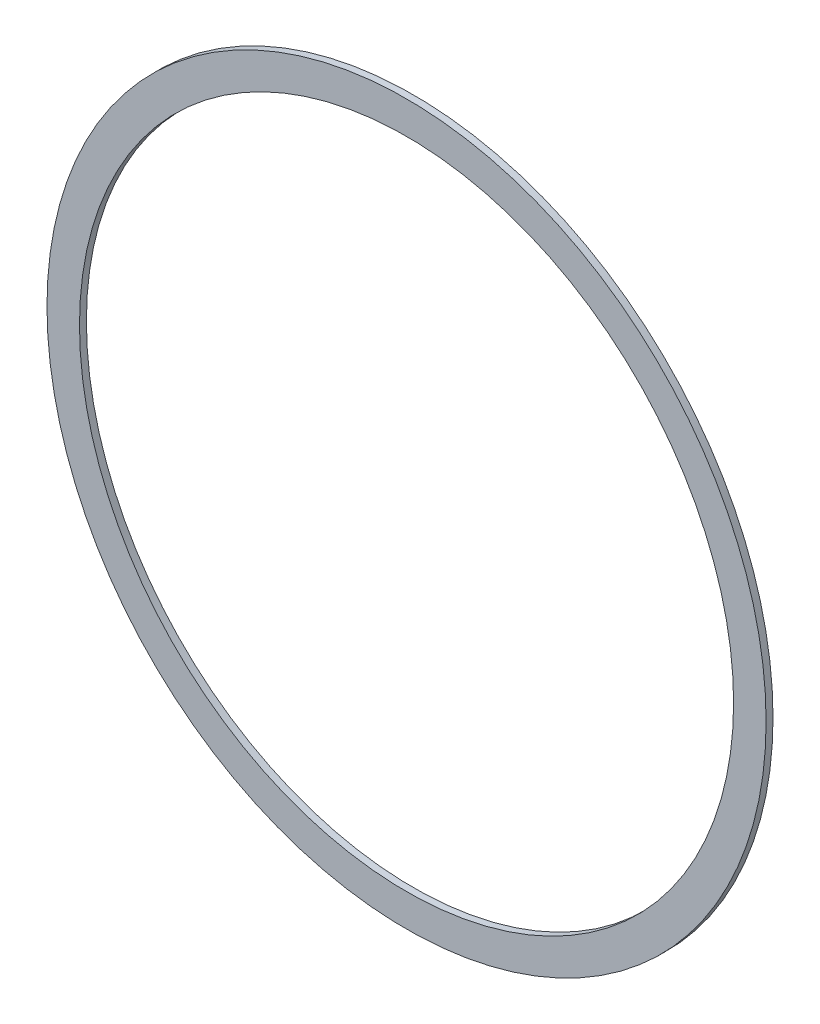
ISO-10303-21;
HEADER;
FILE_DESCRIPTION(('STEP AP214'),'2;1');
FILE_NAME('part.step','',(''),(''),'','','');
FILE_SCHEMA(('AUTOMOTIVE_DESIGN { 1 0 10303 214 1 1 1 1 }'));
ENDSEC;
DATA;
#1=APPLICATION_CONTEXT('core data for automotive mechanical design processes');
#2=APPLICATION_PROTOCOL_DEFINITION('international standard','automotive_design',2000,#1);
#3=PRODUCT_CONTEXT('',#1,'mechanical');
#4=PRODUCT('Part','Part','',(#3));
#5=PRODUCT_RELATED_PRODUCT_CATEGORY('part','',(#4));
#6=PRODUCT_DEFINITION_FORMATION('','',#4);
#7=PRODUCT_DEFINITION_CONTEXT('part definition',#1,'design');
#8=PRODUCT_DEFINITION('design','',#6,#7);
#9=PRODUCT_DEFINITION_SHAPE('','',#8);
#10=(LENGTH_UNIT() NAMED_UNIT(*) SI_UNIT(.MILLI.,.METRE.));
#11=(NAMED_UNIT(*) PLANE_ANGLE_UNIT() SI_UNIT($,.RADIAN.));
#12=(NAMED_UNIT(*) SI_UNIT($,.STERADIAN.) SOLID_ANGLE_UNIT());
#13=UNCERTAINTY_MEASURE_WITH_UNIT(LENGTH_MEASURE(1.E-05),#10,'distance_accuracy_value','');
#14=(GEOMETRIC_REPRESENTATION_CONTEXT(3) GLOBAL_UNCERTAINTY_ASSIGNED_CONTEXT((#13)) GLOBAL_UNIT_ASSIGNED_CONTEXT((#10,
#11,#12)) REPRESENTATION_CONTEXT('',''));
#15=CARTESIAN_POINT('',(0.,0.,0.));
#16=DIRECTION('',(0.,0.,1.));
#17=DIRECTION('',(1.,0.,0.));
#18=AXIS2_PLACEMENT_3D('',#15,#16,#17);
#19=CARTESIAN_POINT('',(0.,24.7771123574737,0.5));
#20=DIRECTION('',(0.,0.,1.));
#21=DIRECTION('',(1.,0.,0.));
#22=AXIS2_PLACEMENT_3D('',#19,#20,#21);
#23=PLANE('',#22);
#24=CARTESIAN_POINT('',(0.,24.7771123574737,0.5));
#25=DIRECTION('',(0.,0.,1.));
#26=DIRECTION('',(1.,0.,0.));
#27=AXIS2_PLACEMENT_3D('',#24,#25,#26);
#28=CIRCLE('',#27,26.);
#29=CARTESIAN_POINT('',(26.,24.7771123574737,0.5));
#30=VERTEX_POINT('',#29);
#31=EDGE_CURVE('E10',#30,#30,#28,.T.);
#32=ORIENTED_EDGE('',*,*,#31,.T.);
#33=EDGE_LOOP('',(#32));
#34=FACE_BOUND('',#33,.T.);
#35=CARTESIAN_POINT('',(0.,24.7771123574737,0.5));
#36=DIRECTION('',(0.,0.,1.));
#37=DIRECTION('',(1.,0.,0.));
#38=AXIS2_PLACEMENT_3D('',#35,#36,#37);
#39=CIRCLE('',#38,23.6500000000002);
#40=CARTESIAN_POINT('',(23.6500000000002,24.7771123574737,0.5));
#41=VERTEX_POINT('',#40);
#42=EDGE_CURVE('E38',#41,#41,#39,.T.);
#43=ORIENTED_EDGE('',*,*,#42,.F.);
#44=EDGE_LOOP('',(#43));
#45=FACE_BOUND('',#44,.T.);
#46=ADVANCED_FACE('F27',(#34,#45),#23,.T.);
#47=CARTESIAN_POINT('',(0.,24.7771123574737,0.));
#48=DIRECTION('',(0.,0.,1.));
#49=DIRECTION('',(1.,0.,0.));
#50=AXIS2_PLACEMENT_3D('',#47,#48,#49);
#51=PLANE('',#50);
#52=CARTESIAN_POINT('',(0.,24.7771123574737,0.));
#53=DIRECTION('',(0.,0.,1.));
#54=DIRECTION('',(1.,0.,0.));
#55=AXIS2_PLACEMENT_3D('',#52,#53,#54);
#56=CIRCLE('',#55,26.);
#57=CARTESIAN_POINT('',(26.,24.7771123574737,0.));
#58=VERTEX_POINT('',#57);
#59=EDGE_CURVE('E34',#58,#58,#56,.T.);
#60=ORIENTED_EDGE('',*,*,#59,.F.);
#61=EDGE_LOOP('',(#60));
#62=FACE_BOUND('',#61,.T.);
#63=CARTESIAN_POINT('',(0.,24.7771123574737,0.));
#64=DIRECTION('',(0.,0.,1.));
#65=DIRECTION('',(1.,0.,0.));
#66=AXIS2_PLACEMENT_3D('',#63,#64,#65);
#67=CIRCLE('',#66,23.6500000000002);
#68=CARTESIAN_POINT('',(23.6500000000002,24.7771123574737,0.));
#69=VERTEX_POINT('',#68);
#70=EDGE_CURVE('E42',#69,#69,#67,.T.);
#71=ORIENTED_EDGE('',*,*,#70,.T.);
#72=EDGE_LOOP('',(#71));
#73=FACE_BOUND('',#72,.T.);
#74=ADVANCED_FACE('F48',(#62,#73),#51,.F.);
#75=CARTESIAN_POINT('',(0.,24.7771123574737,0.5));
#76=DIRECTION('',(0.,0.,-1.));
#77=DIRECTION('',(-1.,0.,0.));
#78=AXIS2_PLACEMENT_3D('',#75,#76,#77);
#79=CYLINDRICAL_SURFACE('',#78,26.);
#80=ORIENTED_EDGE('',*,*,#31,.F.);
#81=EDGE_LOOP('',(#80));
#82=FACE_BOUND('',#81,.T.);
#83=ORIENTED_EDGE('',*,*,#59,.T.);
#84=EDGE_LOOP('',(#83));
#85=FACE_BOUND('',#84,.T.);
#86=ADVANCED_FACE('F29',(#82,#85),#79,.T.);
#87=CARTESIAN_POINT('',(0.,24.7771123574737,0.5));
#88=DIRECTION('',(0.,0.,-1.));
#89=DIRECTION('',(-1.,0.,0.));
#90=AXIS2_PLACEMENT_3D('',#87,#88,#89);
#91=CYLINDRICAL_SURFACE('',#90,23.6500000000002);
#92=ORIENTED_EDGE('',*,*,#42,.T.);
#93=EDGE_LOOP('',(#92));
#94=FACE_BOUND('',#93,.T.);
#95=ORIENTED_EDGE('',*,*,#70,.F.);
#96=EDGE_LOOP('',(#95));
#97=FACE_BOUND('',#96,.T.);
#98=ADVANCED_FACE('F50',(#94,#97),#91,.F.);
#99=CLOSED_SHELL('',(#46,#74,#86,#98));
#100=MANIFOLD_SOLID_BREP('B2',#99);
#101=ADVANCED_BREP_SHAPE_REPRESENTATION('',(#18,#100),#14);
#102=SHAPE_DEFINITION_REPRESENTATION(#9,#101);
ENDSEC;
END-ISO-10303-21;
